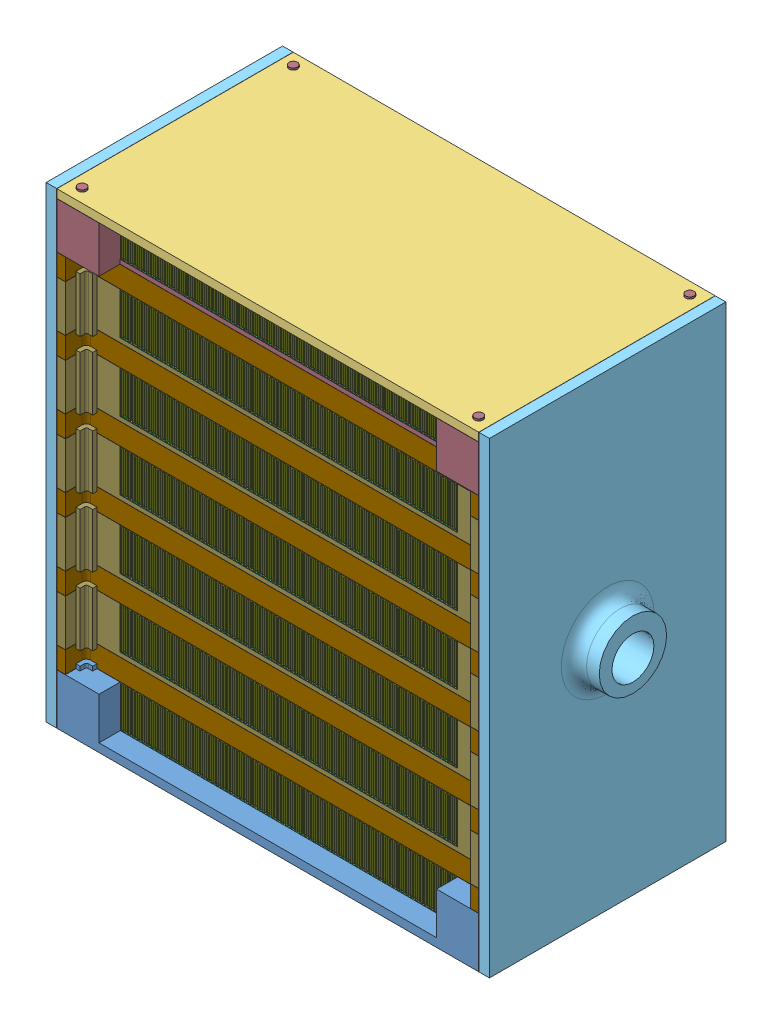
SolidWorks assembly 0. Heat Exchanger Assembly.SLDASM, configuration Default (file format 12000). Lengths in mm.
Overall size (117.2 111.35 56.1).
57 component instances, 13 part files, 171 mates.
Components (placement in the parent):
- 1. Base Plate-1: 1. Base Plate.SLDPRT [Default] at (-174.8595 0 0) x (-1 0 0) z (0 0 1) size (100.1 13 56.1)
- 10. Foil Top plate Side-1: 10. Foil Top plate Side.SLDPRT [Default] at (-174.8595 108.9 0) x (-1 0 0) z (0 0 1) size (100.1 0.05 56.1)
- 11. Top Plate-1: 11. Top Plate.SLDPRT [Default] at (-274.9595 108.9 0) size (100.1 2 56.1)
- 12. Foil Side-1: 12. Foil Side.SLDPRT [Default] at (-174.8095 109.5 -56.1) x (0 -1 0) z (0 0 -1) size (110.9 0.05 56.1)
- 13. Side Plate-1: 13. Side Plate.SLDPRT [Default] at (-174.8095 54.75 -28.05) x (0 -1 0) z (0 0 1) size (110.9 8.5 56.1)
- 2. Foil base plate side-1: 2. Foil base plate side.SLDPRT [Default] at (-264.9095 2 -5.05) size (80 0.05 41)
- 3. Fin Air Side-1: 3. Fin Air Side.SLDPRT [Default] at (-264.5095 2.075 -46.05) x (1 0 0) z (0 -1 0) size (79.95 41 9.9)
- 4. Foil Air Water Side-1: 4. Foil Air Water Side.SLDPRT [Default] at (-274.9595 12 0) size (100.1 0.05 56.1)
- 5. Water base plate-1: 5. Water base plate.SLDPRT [Default] at (-274.9595 12.05 0) size (100.1 5.05 56.1)
- 6. Foil Water Side-1: 6. Foil Water Side.SLDPRT [Default] at (-267.4595 13.05 -7) size (85.1 0.05 37.1)
- 7. Fin Water Side-1: 7. Fin Water Side.SLDPRT [Default] at (-267.4095 17.1 -43.7) x (0 0 1) z (0 1 0) size (37.05 85 4)
- 8. Air Base Plate-1: 8. Air Base Plate.SLDPRT [Default] at (-174.8595 17.15 0) x (-1 0 0) z (0 0 1) size (100.1 12.9 56.1)
- 4. Foil Air Water Side-2: 4. Foil Air Water Side.SLDPRT [Default] at (-274.9595 17.1 0) size (100.1 0.05 56.1)
- 2. Foil base plate side-2: 2. Foil base plate side.SLDPRT [Default] at (-264.9095 18.15 -5.05) size (80 0.05 41)
- 3. Fin Air Side-2: 3. Fin Air Side.SLDPRT [Default] at (-264.5095 18.225 -46.05) x (1 0 0) z (0 -1 0) size (79.95 41 9.9)
- 4. Foil Air Water Side-3: 4. Foil Air Water Side.SLDPRT [Default] at (-274.9595 33.25 0) size (100.1 0.05 56.1)
- 8. Air Base Plate-3: 8. Air Base Plate.SLDPRT [Default] at (-174.8595 33.3 0) x (-1 0 0) z (0 0 1) size (100.1 12.9 56.1)
- 7. Fin Water Side-2: 7. Fin Water Side.SLDPRT [Default] at (-267.4095 33.25 -43.7) x (0 0 1) z (0 1 0) size (37.05 85 4)
- 5. Water base plate-2: 5. Water base plate.SLDPRT [Default] at (-274.9595 28.2 0) size (100.1 5.05 56.1)
- 4. Foil Air Water Side-6: 4. Foil Air Water Side.SLDPRT [Default] at (-274.9595 28.15 0) size (100.1 0.05 56.1)
- 6. Foil Water Side-2: 6. Foil Water Side.SLDPRT [Default] at (-267.4595 29.2 -7) size (85.1 0.05 37.1)
- 3. Fin Air Side-4: 3. Fin Air Side.SLDPRT [Default] at (-264.5095 34.375 -46.05) x (1 0 0) z (0 -1 0) size (79.95 41 9.9)
- 2. Foil base plate side-5: 2. Foil base plate side.SLDPRT [Default] at (-264.9095 34.3 -5.05) size (80 0.05 41)
- 4. Foil Air Water Side-8: 4. Foil Air Water Side.SLDPRT [Default] at (-274.9595 44.3 0) size (100.1 0.05 56.1)
- 5. Water base plate-5: 5. Water base plate.SLDPRT [Default] at (-274.9595 44.35 0) size (100.1 5.05 56.1)
- 6. Foil Water Side-4: 6. Foil Water Side.SLDPRT [Default] at (-267.4595 45.35 -7) size (85.1 0.05 37.1)
- 7. Fin Water Side-4: 7. Fin Water Side.SLDPRT [Default] at (-267.4095 49.4 -43.7) x (0 0 1) z (0 1 0) size (37.05 85 4)
- 4. Foil Air Water Side-10: 4. Foil Air Water Side.SLDPRT [Default] at (-274.9595 49.4 0) size (100.1 0.05 56.1)
- 8. Air Base Plate-5: 8. Air Base Plate.SLDPRT [Default] at (-174.8595 49.45 0) x (-1 0 0) z (0 0 1) size (100.1 12.9 56.1)
- 2. Foil base plate side-7: 2. Foil base plate side.SLDPRT [Default] at (-264.9095 50.45 -5.05) size (80 0.05 41)
- 3. Fin Air Side-6: 3. Fin Air Side.SLDPRT [Default] at (-264.5095 50.525 -46.05) x (1 0 0) z (0 -1 0) size (79.95 41 9.9)
- 5. Water base plate-7: 5. Water base plate.SLDPRT [Default] at (-274.9595 60.5 0) size (100.1 5.05 56.1)
- 6. Foil Water Side-6: 6. Foil Water Side.SLDPRT [Default] at (-267.4595 61.5 -7) size (85.1 0.05 37.1)
- 4. Foil Air Water Side-12: 4. Foil Air Water Side.SLDPRT [Default] at (-274.9595 60.45 0) size (100.1 0.05 56.1)
- 7. Fin Water Side-6: 7. Fin Water Side.SLDPRT [Default] at (-267.4095 65.55 -43.7) x (0 0 1) z (0 1 0) size (37.05 85 4)
- 4. Foil Air Water Side-14: 4. Foil Air Water Side.SLDPRT [Default] at (-274.9595 65.55 0) size (100.1 0.05 56.1)
- 8. Air Base Plate-7: 8. Air Base Plate.SLDPRT [Default] at (-174.8595 65.6 0) x (-1 0 0) z (0 0 1) size (100.1 12.9 56.1)
- 3. Fin Air Side-8: 3. Fin Air Side.SLDPRT [Default] at (-264.5095 66.675 -46.05) x (1 0 0) z (0 -1 0) size (79.95 41 9.9)
- 2. Foil base plate side-9: 2. Foil base plate side.SLDPRT [Default] at (-264.9095 66.6 -5.05) size (80 0.05 41)
- 4. Foil Air Water Side-16: 4. Foil Air Water Side.SLDPRT [Default] at (-274.9595 76.6 0) size (100.1 0.05 56.1)
- 5. Water base plate-9: 5. Water base plate.SLDPRT [Default] at (-274.9595 76.65 0) size (100.1 5.05 56.1)
- 6. Foil Water Side-8: 6. Foil Water Side.SLDPRT [Default] at (-267.4595 77.65 -7) size (85.1 0.05 37.1)
- 7. Fin Water Side-8: 7. Fin Water Side.SLDPRT [Default] at (-267.4095 81.7 -43.7) x (0 0 1) z (0 1 0) size (37.05 85 4)
- 4. Foil Air Water Side-18: 4. Foil Air Water Side.SLDPRT [Default] at (-274.9595 81.7 0) size (100.1 0.05 56.1)
- 2. Foil base plate side-11: 2. Foil base plate side.SLDPRT [Default] at (-264.9095 82.75 -5.05) size (80 0.05 41)
- 3. Fin Air Side-10: 3. Fin Air Side.SLDPRT [Default] at (-264.5095 82.825 -46.05) x (1 0 0) z (0 -1 0) size (79.95 41 9.9)
- 8. Air Base Plate-9: 8. Air Base Plate.SLDPRT [Default] at (-174.8595 81.75 0) x (-1 0 0) z (0 0 1) size (100.1 12.9 56.1)
- 4. Foil Air Water Side-19: 4. Foil Air Water Side.SLDPRT [Default] at (-274.9595 92.75 0) size (100.1 0.05 56.1)
- 5. Water base plate-11: 5. Water base plate.SLDPRT [Default] at (-274.9595 92.8 0) size (100.1 5.05 56.1)
- 6. Foil Water Side-10: 6. Foil Water Side.SLDPRT [Default] at (-267.4595 93.8 -7) size (85.1 0.05 37.1)
- 7. Fin Water Side-10: 7. Fin Water Side.SLDPRT [Default] at (-267.4095 97.85 -43.7) x (0 0 1) z (0 1 0) size (37.05 85 4)
- 4. Foil Air Water Side-22: 4. Foil Air Water Side.SLDPRT [Default] at (-274.9595 97.85 0) size (100.1 0.05 56.1)
- 2. Foil base plate side-14: 2. Foil base plate side.SLDPRT [Default] at (-264.9595 98.9 -5.05) size (80 0.05 41)
- 3. Fin Air Side-13: 3. Fin Air Side.SLDPRT [Default] at (-264.5345 98.95 -46.05) x (1 0 0) z (0 -1 0) size (79.95 41 9.9)
- 9. Top Air Plate-2: 9. Top Air Plate.SLDPRT [Default] at (-184.8595 105.8 -46.1) x (-1 0 0) z (0 0 -1) size (100.1 14.45 56.1)
- 13. Side Plate-2: 13. Side Plate.SLDPRT [Default] at (-275.0095 54.75 -28.05) x (0 -1 0) z (0 0 -1) size (110.9 8.5 56.1)
- 12. Foil Side-2: 12. Foil Side.SLDPRT [Default] at (-274.9595 109.5 -56.1) x (0 -1 0) z (0 0 -1) size (110.9 0.05 56.1)
Mates (geometry in assembly coordinates):
- Coincident3: coincident anti-aligned: plane of 1. Base Plate-1 through (-174.8595 2 0) normal (0 1 0); plane of 2. Foil base plate side-1 through (-264.9095 2 -5.05) normal (0 -1 0)
- Width2: width anti-aligned: plane of 1. Base Plate-1 through (-264.9595 4.5 0) normal (1 0 0); plane of 2. Foil base plate side-1 through (-184.8595 4.5 0) normal (-1 0 0); plane of 1. Base Plate-1 through (-264.9095 2.05 -5.05) normal (-1 0 0); plane of 2. Foil base plate side-1 through (-184.9095 2.05 -5.05) normal (1 0 0)
- Parallel1: parallel anti-aligned: plane of 1. Base Plate-1 through (-268.4595 12 -43.1) normal (0 1 0); plane of 3. Fin Air Side-1 through (-264.5095 2.075 -46.05) normal (0 -1 0)
- Width4: width anti-aligned: plane of 3. Fin Air Side-1 through (-264.8845 2.075 -5.05) normal (-1 0 0); plane of 1. Base Plate-1 through (-184.9345 2.075 -5.05) normal (1 0 0); plane of 3. Fin Air Side-1 through (-264.9595 4.5 0) normal (1 0 0); plane of 1. Base Plate-1 through (-184.8595 4.5 0) normal (-1 0 0)
- Coincident6: coincident anti-aligned: plane of 1. Base Plate-1 through (-268.4595 12 -43.1) normal (0 1 0); plane of 4. Foil Air Water Side-1 through (-268.4595 12 -8) normal (0 -1 0)
- Coincident7: coincident aligned: plane of 1. Base Plate-1 through (-274.9595 4.5 0) normal (-1 0 0); plane of 4. Foil Air Water Side-1 through (-274.9595 12.05 0) normal (-1 0 0)
- Coincident8: coincident aligned: plane of 1. Base Plate-1 through (-174.8595 4.5 0) normal (0 0 1); plane of 4. Foil Air Water Side-1 through (-274.9595 12.05 0) normal (0 0 1)
- Coincident9: coincident anti-aligned: plane of 4. Foil Air Water Side-1 through (-268.4595 12.05 -8) normal (0 1 0); plane of 5. Water base plate-1 through (-274.9595 12.05 0) normal (0 -1 0)
- Coincident10: coincident aligned: plane of 1. Base Plate-1 through (-174.8595 4.5 -56.1) normal (0 0 -1); plane of 5. Water base plate-1 through (-274.9595 17.1 -56.1) normal (0 0 -1)
- Coincident11: coincident aligned: plane of 1. Base Plate-1 through (-174.8595 4.5 0) normal (1 0 0); plane of 5. Water base plate-1 through (-174.8595 17.1 0) normal (1 0 0)
- Coincident12: coincident anti-aligned: plane of 5. Water base plate-1 through (-274.9595 13.05 0) normal (0 1 0); plane of 6. Foil Water Side-1 through (-267.4595 13.05 -7) normal (0 -1 0)
- Width6: width anti-aligned: plane of 6. Foil Water Side-1 through (-182.3595 13.1 -7) normal (1 0 0); plane of 5. Water base plate-1 through (-267.4595 13.1 -7) normal (-1 0 0); plane of 6. Foil Water Side-1 through (-267.4595 13.05 0) normal (-1 0 0); plane of 5. Water base plate-1 through (-182.3595 13.05 0) normal (1 0 0)
- Width8: width anti-aligned: plane of 6. Foil Water Side-1 through (-267.4595 13.1 -7) normal (0 0 1); plane of 5. Water base plate-1 through (-267.4595 13.1 -44.1) normal (0 0 -1); plane of 6. Foil Water Side-1 through (-274.9595 17.1 -46.1) normal (0 0 -1); plane of 5. Water base plate-1 through (-274.9595 17.1 -5) normal (0 0 1)
- Width9: width anti-aligned: plane of 7. Fin Water Side-1 through (-182.4095 17.1 -43.7) normal (1 0 0); plane of 1. Base Plate-1 through (-267.4095 17.1 -43.7) normal (-1 0 0); plane of 7. Fin Water Side-1 through (-267.4595 12 0) normal (-1 0 0); plane of 1. Base Plate-1 through (-182.3595 12 0) normal (1 0 0)
- Width10: width anti-aligned: plane of 7. Fin Water Side-1 through (-182.4095 17.1 -44.075) normal (0 0 -1); plane of 5. Water base plate-1 through (-182.4095 17.1 -7.025) normal (0 0 1); plane of 7. Fin Water Side-1 through (-274.9595 17.1 -44.1) normal (0 0 1); plane of 5. Water base plate-1 through (-274.9595 17.1 -7) normal (0 0 -1)
- Coincident13: coincident aligned: plane of 2. Foil base plate side-1 through (-264.9095 2.05 -46.05) normal (0 0 -1); plane of 3. Fin Air Side-1 through (-264.5095 2.075 -46.05) normal (0 0 -1)
- Distance1: distance = 0.025 mm anti-aligned: plane of 3. Fin Air Side-1 through (-264.5095 2.075 -5.05) normal (0 -1 0); plane of 2. Foil base plate side-1 through (-264.9095 2.05 -5.05) normal (0 1 0)
- Coincident14: coincident anti-aligned: plane of 5. Water base plate-1 through (-274.9595 17.1 0) normal (0 1 0); plane of 4. Foil Air Water Side-2 through (-268.4595 17.1 -8) normal (0 -1 0)
- Coincident15: coincident aligned: plane of 1. Base Plate-1 through (-274.9595 4.5 0) normal (-1 0 0); plane of 4. Foil Air Water Side-2 through (-274.9595 17.15 0) normal (-1 0 0)
- Coincident16: coincident aligned: plane of 1. Base Plate-1 through (-174.8595 4.5 0) normal (0 0 1); plane of 4. Foil Air Water Side-2 through (-274.9595 17.15 0) normal (0 0 1)
- Coincident21: coincident anti-aligned: plane of 8. Air Base Plate-1 through (-174.8595 17.15 0) normal (0 -1 0); plane of 4. Foil Air Water Side-2 through (-268.4595 17.15 -8) normal (0 1 0)
- Coincident22: coincident aligned: plane of 5. Water base plate-1 through (-274.9595 17.1 -56.1) normal (0 0 -1); plane of 8. Air Base Plate-1 through (-174.8595 28.15 -56.1) normal (0 0 -1)
- Coincident23: coincident aligned: plane of 5. Water base plate-1 through (-174.8595 17.1 0) normal (1 0 0); plane of 8. Air Base Plate-1 through (-174.8595 28.15 0) normal (1 0 0)
- Tangent1: tangent anti-aligned: cylinder of 6. Foil Water Side-1; cylinder of 7. Fin Water Side-1 through (-182.4095 13.475 -33.8) axis (-1 0 0) radius 0.375
- Distance4: distance = 5.05 mm aligned: plane of 2. Foil base plate side-1 through (-264.9095 2.05 -5.05) normal (0 0 1); plane of 1. Base Plate-1 through (-174.8595 4.5 0) normal (0 0 1)
- Width11: width anti-aligned: plane of 7. Fin Water Side-2 through (-182.4095 33.25 -44.075) normal (0 0 -1); plane of 7. Fin Water Side-2 through (-182.4095 33.25 -7.025) normal (0 0 1); plane of 5. Water base plate-2 through (-274.9595 33.25 -44.1) normal (0 0 1); plane of 5. Water base plate-2 through (-274.9595 33.25 -7) normal (0 0 -1)
- Coincident24: coincident aligned: plane of 2. Foil base plate side-2 through (-264.9095 18.2 -46.05) normal (0 0 -1); plane of 3. Fin Air Side-2 through (-264.5095 18.225 -46.05) normal (0 0 -1)
- Distance5: distance = 0.025 mm anti-aligned: plane of 3. Fin Air Side-2 through (-264.5095 18.225 -5.05) normal (0 -1 0); plane of 2. Foil base plate side-2 through (-264.9095 18.2 -5.05) normal (0 1 0)
- Coincident25: coincident anti-aligned: plane of 4. Foil Air Water Side-3 through (-268.4595 33.25 -8) normal (0 -1 0); plane of 5. Water base plate-2 through (-274.9595 33.25 0) normal (0 1 0)
- Coincident26: coincident anti-aligned: plane of 4. Foil Air Water Side-3 through (-268.4595 33.3 -8) normal (0 1 0); plane of 8. Air Base Plate-3 through (-174.8595 33.3 0) normal (0 -1 0)
- Coincident27: coincident aligned: plane of 8. Air Base Plate-3 through (-174.8595 44.3 -56.1) normal (0 0 -1); plane of 5. Water base plate-2 through (-274.9595 33.25 -56.1) normal (0 0 -1)
- Coincident28: coincident aligned: plane of 8. Air Base Plate-3 through (-174.8595 44.3 0) normal (1 0 0); plane of 5. Water base plate-2 through (-174.8595 33.25 0) normal (1 0 0)
- Coincident29: coincident anti-aligned: plane of 8. Air Base Plate-1 through (-174.8595 18.15 0) normal (0 1 0); plane of 2. Foil base plate side-2 through (-264.9095 18.15 -5.05) normal (0 -1 0)
- Width12: width anti-aligned: plane of 1. Base Plate-1 through (-264.9595 4.5 0) normal (1 0 0); plane of 1. Base Plate-1 through (-184.8595 4.5 0) normal (-1 0 0); plane of 2. Foil base plate side-2 through (-264.9095 18.2 -5.05) normal (-1 0 0); plane of 2. Foil base plate side-2 through (-184.9095 18.2 -5.05) normal (1 0 0)
- Parallel4: parallel anti-aligned: plane of 8. Air Base Plate-1 through (-174.8595 28.15 0) normal (0 1 0); plane of 3. Fin Air Side-2 through (-264.5095 18.225 -46.05) normal (0 -1 0)
- Width13: width anti-aligned: plane of 3. Fin Air Side-2 through (-264.8845 18.225 -5.05) normal (-1 0 0); plane of 3. Fin Air Side-2 through (-184.9345 18.225 -5.05) normal (1 0 0); plane of 1. Base Plate-1 through (-264.9595 4.5 0) normal (1 0 0); plane of 1. Base Plate-1 through (-184.8595 4.5 0) normal (-1 0 0)
- Coincident31: coincident aligned: plane of 1. Base Plate-1 through (-174.8595 4.5 -56.1) normal (0 0 -1); plane of 5. Water base plate-2 through (-274.9595 33.25 -56.1) normal (0 0 -1)
- Coincident32: coincident aligned: plane of 1. Base Plate-1 through (-174.8595 4.5 0) normal (1 0 0); plane of 5. Water base plate-2 through (-174.8595 33.25 0) normal (1 0 0)
- Width14: width anti-aligned: plane of 6. Foil Water Side-1 through (-182.3595 13.1 -7) normal (1 0 0); plane of 6. Foil Water Side-1 through (-267.4595 13.1 -7) normal (-1 0 0); plane of 5. Water base plate-2 through (-267.4595 29.2 0) normal (-1 0 0); plane of 5. Water base plate-2 through (-182.3595 29.2 0) normal (1 0 0)
- Width15: width anti-aligned: plane of 6. Foil Water Side-1 through (-267.4595 13.1 -7) normal (0 0 1); plane of 6. Foil Water Side-1 through (-267.4595 13.1 -44.1) normal (0 0 -1); plane of 5. Water base plate-2 through (-274.9595 33.25 -46.1) normal (0 0 -1); plane of 5. Water base plate-2 through (-274.9595 33.25 -5) normal (0 0 1)
- Width16: width anti-aligned: plane of 7. Fin Water Side-2 through (-182.4095 33.25 -43.7) normal (1 0 0); plane of 7. Fin Water Side-2 through (-267.4095 33.25 -43.7) normal (-1 0 0); plane of 1. Base Plate-1 through (-267.4595 12 0) normal (-1 0 0); plane of 1. Base Plate-1 through (-182.3595 12 0) normal (1 0 0)
- Coincident41: coincident aligned: plane of 4. Foil Air Water Side-3 through (-174.8595 33.3 -44.1) normal (1 0 0); plane of 8. Air Base Plate-3 through (-174.8595 44.3 0) normal (1 0 0)
- Coincident42: coincident aligned: plane of 4. Foil Air Water Side-3 through (-174.8595 33.3 -56.1) normal (0 0 -1); plane of 8. Air Base Plate-3 through (-174.8595 44.3 -56.1) normal (0 0 -1)
- Distance7: distance = 5.05 mm aligned: plane of 2. Foil base plate side-2 through (-264.9095 18.2 -5.05) normal (0 0 1); plane of 1. Base Plate-1 through (-174.8595 4.5 0) normal (0 0 1)
- Coincident45: coincident anti-aligned: plane of 8. Air Base Plate-1 through (-174.8595 28.15 0) normal (0 1 0); plane of 4. Foil Air Water Side-6 through (-268.4595 28.15 -8) normal (0 -1 0)
- Coincident46: coincident aligned: plane of 8. Air Base Plate-1 through (-174.8595 28.15 0) normal (1 0 0); plane of 4. Foil Air Water Side-6 through (-174.8595 28.2 -44.1) normal (1 0 0)
- Coincident47: coincident aligned: plane of 8. Air Base Plate-1 through (-174.8595 28.15 -56.1) normal (0 0 -1); plane of 4. Foil Air Water Side-6 through (-174.8595 28.2 -56.1) normal (0 0 -1)
- Coincident48: coincident anti-aligned: plane of 5. Water base plate-2 through (-274.9595 28.2 0) normal (0 -1 0); plane of 4. Foil Air Water Side-6 through (-268.4595 28.2 -8) normal (0 1 0)
- Coincident49: coincident anti-aligned: plane of 5. Water base plate-2 through (-274.9595 29.2 0) normal (0 1 0); plane of 6. Foil Water Side-2 through (-267.4595 29.2 -7) normal (0 -1 0)
- Width23: width anti-aligned: plane of 6. Foil Water Side-2 through (-182.3595 29.25 -7) normal (1 0 0); plane of 6. Foil Water Side-2 through (-267.4595 29.25 -7) normal (-1 0 0); plane of 5. Water base plate-1 through (-267.4595 13.05 0) normal (-1 0 0); plane of 5. Water base plate-1 through (-182.3595 13.05 0) normal (1 0 0)
- Width24: width anti-aligned: plane of 6. Foil Water Side-2 through (-267.4595 29.25 -7) normal (0 0 1); plane of 6. Foil Water Side-2 through (-267.4595 29.25 -44.1) normal (0 0 -1); plane of 5. Water base plate-1 through (-274.9595 17.1 -46.1) normal (0 0 -1); plane of 5. Water base plate-1 through (-274.9595 17.1 -5) normal (0 0 1)
- Tangent2: tangent anti-aligned: cylinder of 7. Fin Water Side-2 through (-182.4095 29.625 -36) axis (-1 0 0) radius 0.375; plane of 6. Foil Water Side-2 through (-267.4595 29.25 -7) normal (0 1 0)
- Coincident51: coincident aligned: plane of 3. Fin Air Side-4 through (-264.5095 34.375 -46.05) normal (0 0 -1); plane of 2. Foil base plate side-5 through (-264.9095 34.35 -46.05) normal (0 0 -1)
- Distance8: distance = 0.025 mm anti-aligned: plane of 3. Fin Air Side-4 through (-264.5095 34.375 -5.05) normal (0 -1 0); plane of 2. Foil base plate side-5 through (-264.9095 34.35 -5.05) normal (0 1 0)
- Coincident52: coincident anti-aligned: plane of 8. Air Base Plate-3 through (-174.8595 34.3 0) normal (0 1 0); plane of 2. Foil base plate side-5 through (-264.9095 34.3 -5.05) normal (0 -1 0)
- Width27: width anti-aligned: plane of 1. Base Plate-1 through (-264.9595 4.5 0) normal (1 0 0); plane of 1. Base Plate-1 through (-184.8595 4.5 0) normal (-1 0 0); plane of 2. Foil base plate side-5 through (-264.9095 34.35 -5.05) normal (-1 0 0); plane of 2. Foil base plate side-5 through (-184.9095 34.35 -5.05) normal (1 0 0)
- Parallel5: parallel anti-aligned: plane of 8. Air Base Plate-1 through (-174.8595 28.15 0) normal (0 1 0); plane of 3. Fin Air Side-4 through (-264.5095 34.375 -46.05) normal (0 -1 0)
- Width28: width anti-aligned: plane of 3. Fin Air Side-4 through (-264.8845 34.375 -5.05) normal (-1 0 0); plane of 3. Fin Air Side-4 through (-184.9345 34.375 -5.05) normal (1 0 0); plane of 1. Base Plate-1 through (-264.9595 4.5 0) normal (1 0 0); plane of 1. Base Plate-1 through (-184.8595 4.5 0) normal (-1 0 0)
- Distance9: distance = 5.05 mm aligned: plane of 2. Foil base plate side-5 through (-264.9095 34.35 -5.05) normal (0 0 1); plane of 1. Base Plate-1 through (-174.8595 4.5 0) normal (0 0 1)
- Coincident54: coincident anti-aligned: plane of 8. Air Base Plate-3 through (-174.8595 44.3 0) normal (0 1 0); plane of 4. Foil Air Water Side-8 through (-268.4595 44.3 -8) normal (0 -1 0)
- Coincident55: coincident aligned: plane of 8. Air Base Plate-1 through (-174.8595 28.15 0) normal (1 0 0); plane of 4. Foil Air Water Side-8 through (-174.8595 44.35 -44.1) normal (1 0 0)
- Coincident56: coincident aligned: plane of 8. Air Base Plate-1 through (-174.8595 28.15 -56.1) normal (0 0 -1); plane of 4. Foil Air Water Side-8 through (-174.8595 44.35 -56.1) normal (0 0 -1)
- Coincident70: coincident anti-aligned: plane of 4. Foil Air Water Side-8 through (-268.4595 44.35 -8) normal (0 1 0); plane of 5. Water base plate-5 through (-274.9595 44.35 0) normal (0 -1 0)
- Coincident71: coincident aligned: plane of 1. Base Plate-1 through (-174.8595 4.5 0) normal (1 0 0); plane of 5. Water base plate-5 through (-174.8595 49.4 0) normal (1 0 0)
- Coincident72: coincident aligned: plane of 1. Base Plate-1 through (-174.8595 4.5 -56.1) normal (0 0 -1); plane of 5. Water base plate-5 through (-274.9595 49.4 -56.1) normal (0 0 -1)
- Tangent3: tangent anti-aligned: plane of 6. Foil Water Side-4 through (-267.4595 45.4 -7) normal (0 1 0); cylinder of 7. Fin Water Side-4 through (-182.4095 45.775 -36) axis (-1 0 0) radius 0.375
- Width31: width anti-aligned: plane of 7. Fin Water Side-4 through (-182.4095 49.4 -44.075) normal (0 0 -1); plane of 7. Fin Water Side-4 through (-182.4095 49.4 -7.025) normal (0 0 1); plane of 5. Water base plate-2 through (-274.9595 33.25 -44.1) normal (0 0 1); plane of 5. Water base plate-2 through (-274.9595 33.25 -7) normal (0 0 -1)
- Width32: width anti-aligned: plane of 7. Fin Water Side-4 through (-182.4095 49.4 -43.7) normal (1 0 0); plane of 7. Fin Water Side-4 through (-267.4095 49.4 -43.7) normal (-1 0 0); plane of 1. Base Plate-1 through (-267.4595 12 0) normal (-1 0 0); plane of 1. Base Plate-1 through (-182.3595 12 0) normal (1 0 0)
- Coincident75: coincident anti-aligned: plane of 5. Water base plate-5 through (-274.9595 45.35 0) normal (0 1 0); plane of 6. Foil Water Side-4 through (-267.4595 45.35 -7) normal (0 -1 0)
- Width33: width anti-aligned: plane of 6. Foil Water Side-4 through (-182.3595 45.4 -7) normal (1 0 0); plane of 6. Foil Water Side-4 through (-267.4595 45.4 -7) normal (-1 0 0); plane of 5. Water base plate-1 through (-267.4595 13.05 0) normal (-1 0 0); plane of 5. Water base plate-1 through (-182.3595 13.05 0) normal (1 0 0)
- Width34: width anti-aligned: plane of 6. Foil Water Side-4 through (-267.4595 45.4 -7) normal (0 0 1); plane of 6. Foil Water Side-4 through (-267.4595 45.4 -44.1) normal (0 0 -1); plane of 5. Water base plate-1 through (-274.9595 17.1 -46.1) normal (0 0 -1); plane of 5. Water base plate-1 through (-274.9595 17.1 -5) normal (0 0 1)
- Coincident76: coincident anti-aligned: plane of 5. Water base plate-5 through (-274.9595 49.4 0) normal (0 1 0); plane of 4. Foil Air Water Side-10 through (-268.4595 49.4 -8) normal (0 -1 0)
- Coincident77: coincident aligned: plane of 8. Air Base Plate-3 through (-174.8595 44.3 0) normal (1 0 0); plane of 4. Foil Air Water Side-10 through (-174.8595 49.45 -44.1) normal (1 0 0)
- Coincident78: coincident aligned: plane of 8. Air Base Plate-3 through (-174.8595 44.3 -56.1) normal (0 0 -1); plane of 4. Foil Air Water Side-10 through (-174.8595 49.45 -56.1) normal (0 0 -1)
- Coincident81: coincident anti-aligned: plane of 4. Foil Air Water Side-10 through (-268.4595 49.45 -8) normal (0 1 0); plane of 8. Air Base Plate-5 through (-174.8595 49.45 0) normal (0 -1 0)
- Coincident82: coincident aligned: plane of 5. Water base plate-2 through (-274.9595 33.25 -56.1) normal (0 0 -1); plane of 8. Air Base Plate-5 through (-174.8595 60.45 -56.1) normal (0 0 -1)
- Coincident83: coincident aligned: plane of 5. Water base plate-2 through (-174.8595 33.25 0) normal (1 0 0); plane of 8. Air Base Plate-5 through (-174.8595 60.45 0) normal (1 0 0)
- Coincident86: coincident aligned: plane of 2. Foil base plate side-7 through (-264.9095 50.5 -46.05) normal (0 0 -1); plane of 3. Fin Air Side-6 through (-264.5095 50.525 -46.05) normal (0 0 -1)
- Distance12: distance = 0.025 mm anti-aligned: plane of 3. Fin Air Side-6 through (-264.5095 50.525 -5.05) normal (0 -1 0); plane of 2. Foil base plate side-7 through (-264.9095 50.5 -5.05) normal (0 1 0)
- Coincident87: coincident anti-aligned: plane of 8. Air Base Plate-5 through (-174.8595 50.45 0) normal (0 1 0); plane of 2. Foil base plate side-7 through (-264.9095 50.45 -5.05) normal (0 -1 0)
- Width39: width anti-aligned: plane of 1. Base Plate-1 through (-264.9595 4.5 0) normal (1 0 0); plane of 1. Base Plate-1 through (-184.8595 4.5 0) normal (-1 0 0); plane of 2. Foil base plate side-7 through (-264.9095 50.5 -5.05) normal (-1 0 0); plane of 2. Foil base plate side-7 through (-184.9095 50.5 -5.05) normal (1 0 0)
- Parallel7: parallel anti-aligned: plane of 8. Air Base Plate-1 through (-174.8595 28.15 0) normal (0 1 0); plane of 3. Fin Air Side-6 through (-264.5095 50.525 -46.05) normal (0 -1 0)
- Width40: width anti-aligned: plane of 3. Fin Air Side-6 through (-264.8845 50.525 -5.05) normal (-1 0 0); plane of 3. Fin Air Side-6 through (-184.9345 50.525 -5.05) normal (1 0 0); plane of 1. Base Plate-1 through (-264.9595 4.5 0) normal (1 0 0); plane of 1. Base Plate-1 through (-184.8595 4.5 0) normal (-1 0 0)
- Distance13: distance = 5.05 mm aligned: plane of 2. Foil base plate side-7 through (-264.9095 50.5 -5.05) normal (0 0 1); plane of 1. Base Plate-1 through (-174.8595 4.5 0) normal (0 0 1)
- Coincident89: coincident anti-aligned: plane of 5. Water base plate-7 through (-274.9595 60.5 0) normal (0 -1 0); plane of 4. Foil Air Water Side-12 through (-268.4595 60.5 -8) normal (0 1 0)
- Coincident90: coincident anti-aligned: plane of 5. Water base plate-7 through (-274.9595 61.5 0) normal (0 1 0); plane of 6. Foil Water Side-6 through (-267.4595 61.5 -7) normal (0 -1 0)
- Coincident91: coincident anti-aligned: plane of 8. Air Base Plate-5 through (-174.8595 60.45 0) normal (0 1 0); plane of 4. Foil Air Water Side-12 through (-268.4595 60.45 -8) normal (0 -1 0)
- Coincident93: coincident aligned: plane of 1. Base Plate-1 through (-174.8595 4.5 0) normal (1 0 0); plane of 5. Water base plate-7 through (-174.8595 65.55 0) normal (1 0 0)
- Coincident94: coincident aligned: plane of 1. Base Plate-1 through (-174.8595 4.5 -56.1) normal (0 0 -1); plane of 5. Water base plate-7 through (-274.9595 65.55 -56.1) normal (0 0 -1)
- Width43: width anti-aligned: plane of 6. Foil Water Side-6 through (-182.3595 61.55 -7) normal (1 0 0); plane of 6. Foil Water Side-6 through (-267.4595 61.55 -7) normal (-1 0 0); plane of 5. Water base plate-1 through (-267.4595 13.05 0) normal (-1 0 0); plane of 5. Water base plate-1 through (-182.3595 13.05 0) normal (1 0 0)
- Width44: width anti-aligned: plane of 6. Foil Water Side-6 through (-267.4595 61.55 -7) normal (0 0 1); plane of 6. Foil Water Side-6 through (-267.4595 61.55 -44.1) normal (0 0 -1); plane of 5. Water base plate-1 through (-274.9595 17.1 -46.1) normal (0 0 -1); plane of 5. Water base plate-1 through (-274.9595 17.1 -5) normal (0 0 1)
- Coincident97: coincident aligned: plane of 8. Air Base Plate-1 through (-174.8595 28.15 0) normal (1 0 0); plane of 4. Foil Air Water Side-12 through (-174.8595 60.5 -44.1) normal (1 0 0)
- Coincident98: coincident aligned: plane of 8. Air Base Plate-1 through (-174.8595 28.15 -56.1) normal (0 0 -1); plane of 4. Foil Air Water Side-12 through (-174.8595 60.5 -56.1) normal (0 0 -1)
- Tangent5: tangent anti-aligned: plane of 6. Foil Water Side-6 through (-267.4595 61.55 -7) normal (0 1 0); cylinder of 7. Fin Water Side-6 through (-182.4095 61.925 -36) axis (-1 0 0) radius 0.375
- Width47: width anti-aligned: plane of 7. Fin Water Side-6 through (-182.4095 65.55 -44.075) normal (0 0 -1); plane of 7. Fin Water Side-6 through (-182.4095 65.55 -7.025) normal (0 0 1); plane of 5. Water base plate-2 through (-274.9595 33.25 -44.1) normal (0 0 1); plane of 5. Water base plate-2 through (-274.9595 33.25 -7) normal (0 0 -1)
- Width48: width anti-aligned: plane of 7. Fin Water Side-6 through (-182.4095 65.55 -43.7) normal (1 0 0); plane of 7. Fin Water Side-6 through (-267.4095 65.55 -43.7) normal (-1 0 0); plane of 1. Base Plate-1 through (-267.4595 12 0) normal (-1 0 0); plane of 1. Base Plate-1 through (-182.3595 12 0) normal (1 0 0)
- Coincident105: coincident anti-aligned: plane of 4. Foil Air Water Side-14 through (-268.4595 65.6 -8) normal (0 1 0); plane of 8. Air Base Plate-7 through (-174.8595 65.6 0) normal (0 -1 0)
- Coincident106: coincident aligned: plane of 3. Fin Air Side-8 through (-264.5095 66.675 -46.05) normal (0 0 -1); plane of 2. Foil base plate side-9 through (-264.9095 66.65 -46.05) normal (0 0 -1)
- Distance16: distance = 0.025 mm anti-aligned: plane of 3. Fin Air Side-8 through (-264.5095 66.675 -5.05) normal (0 -1 0); plane of 2. Foil base plate side-9 through (-264.9095 66.65 -5.05) normal (0 1 0)
- Coincident107: coincident anti-aligned: plane of 8. Air Base Plate-7 through (-174.8595 66.6 0) normal (0 1 0); plane of 2. Foil base plate side-9 through (-264.9095 66.6 -5.05) normal (0 -1 0)
- Coincident108: coincident anti-aligned: plane of 5. Water base plate-7 through (-274.9595 65.55 0) normal (0 1 0); plane of 4. Foil Air Water Side-14 through (-268.4595 65.55 -8) normal (0 -1 0)
- Coincident109: coincident aligned: plane of 8. Air Base Plate-3 through (-174.8595 44.3 0) normal (1 0 0); plane of 4. Foil Air Water Side-14 through (-174.8595 65.6 -44.1) normal (1 0 0)
- Coincident110: coincident aligned: plane of 8. Air Base Plate-3 through (-174.8595 44.3 -56.1) normal (0 0 -1); plane of 4. Foil Air Water Side-14 through (-174.8595 65.6 -56.1) normal (0 0 -1)
- Coincident111: coincident aligned: plane of 5. Water base plate-2 through (-274.9595 33.25 -56.1) normal (0 0 -1); plane of 8. Air Base Plate-7 through (-174.8595 76.6 -56.1) normal (0 0 -1)
- Coincident112: coincident aligned: plane of 5. Water base plate-2 through (-174.8595 33.25 0) normal (1 0 0); plane of 8. Air Base Plate-7 through (-174.8595 76.6 0) normal (1 0 0)
- Width51: width anti-aligned: plane of 1. Base Plate-1 through (-264.9595 4.5 0) normal (1 0 0); plane of 1. Base Plate-1 through (-184.8595 4.5 0) normal (-1 0 0); plane of 2. Foil base plate side-9 through (-264.9095 66.65 -5.05) normal (-1 0 0); plane of 2. Foil base plate side-9 through (-184.9095 66.65 -5.05) normal (1 0 0)
- Parallel9: parallel anti-aligned: plane of 8. Air Base Plate-1 through (-174.8595 28.15 0) normal (0 1 0); plane of 3. Fin Air Side-8 through (-264.5095 66.675 -46.05) normal (0 -1 0)
- Width52: width anti-aligned: plane of 3. Fin Air Side-8 through (-264.8845 66.675 -5.05) normal (-1 0 0); plane of 3. Fin Air Side-8 through (-184.9345 66.675 -5.05) normal (1 0 0); plane of 1. Base Plate-1 through (-264.9595 4.5 0) normal (1 0 0); plane of 1. Base Plate-1 through (-184.8595 4.5 0) normal (-1 0 0)
- Distance17: distance = 5.05 mm aligned: plane of 2. Foil base plate side-9 through (-264.9095 66.65 -5.05) normal (0 0 1); plane of 1. Base Plate-1 through (-174.8595 4.5 0) normal (0 0 1)
- Coincident120: coincident anti-aligned: plane of 4. Foil Air Water Side-16 through (-268.4595 76.65 -8) normal (0 1 0); plane of 5. Water base plate-9 through (-274.9595 76.65 0) normal (0 -1 0)
- Coincident121: coincident anti-aligned: plane of 5. Water base plate-9 through (-274.9595 77.65 0) normal (0 1 0); plane of 6. Foil Water Side-8 through (-267.4595 77.65 -7) normal (0 -1 0)
- Coincident122: coincident anti-aligned: plane of 8. Air Base Plate-7 through (-174.8595 76.6 0) normal (0 1 0); plane of 4. Foil Air Water Side-16 through (-268.4595 76.6 -8) normal (0 -1 0)
- Coincident123: coincident aligned: plane of 1. Base Plate-1 through (-174.8595 4.5 0) normal (1 0 0); plane of 5. Water base plate-9 through (-174.8595 81.7 0) normal (1 0 0)
- Coincident124: coincident aligned: plane of 1. Base Plate-1 through (-174.8595 4.5 -56.1) normal (0 0 -1); plane of 5. Water base plate-9 through (-274.9595 81.7 -56.1) normal (0 0 -1)
- Width55: width anti-aligned: plane of 6. Foil Water Side-8 through (-182.3595 77.7 -7) normal (1 0 0); plane of 6. Foil Water Side-8 through (-267.4595 77.7 -7) normal (-1 0 0); plane of 5. Water base plate-1 through (-267.4595 13.05 0) normal (-1 0 0); plane of 5. Water base plate-1 through (-182.3595 13.05 0) normal (1 0 0)
- Width56: width anti-aligned: plane of 6. Foil Water Side-8 through (-267.4595 77.7 -7) normal (0 0 1); plane of 6. Foil Water Side-8 through (-267.4595 77.7 -44.1) normal (0 0 -1); plane of 5. Water base plate-1 through (-274.9595 17.1 -46.1) normal (0 0 -1); plane of 5. Water base plate-1 through (-274.9595 17.1 -5) normal (0 0 1)
- Coincident125: coincident aligned: plane of 8. Air Base Plate-1 through (-174.8595 28.15 0) normal (1 0 0); plane of 4. Foil Air Water Side-16 through (-174.8595 76.65 -44.1) normal (1 0 0)
- Coincident126: coincident aligned: plane of 8. Air Base Plate-1 through (-174.8595 28.15 -56.1) normal (0 0 -1); plane of 4. Foil Air Water Side-16 through (-174.8595 76.65 -56.1) normal (0 0 -1)
- Tangent6: tangent anti-aligned: plane of 6. Foil Water Side-8 through (-267.4595 77.7 -7) normal (0 1 0); cylinder of 7. Fin Water Side-8 through (-182.4095 78.075 -36) axis (-1 0 0) radius 0.375
- Width59: width anti-aligned: plane of 7. Fin Water Side-8 through (-182.4095 81.7 -44.075) normal (0 0 -1); plane of 7. Fin Water Side-8 through (-182.4095 81.7 -7.025) normal (0 0 1); plane of 5. Water base plate-2 through (-274.9595 33.25 -44.1) normal (0 0 1); plane of 5. Water base plate-2 through (-274.9595 33.25 -7) normal (0 0 -1)
- Width60: width anti-aligned: plane of 7. Fin Water Side-8 through (-182.4095 81.7 -43.7) normal (1 0 0); plane of 7. Fin Water Side-8 through (-267.4095 81.7 -43.7) normal (-1 0 0); plane of 1. Base Plate-1 through (-267.4595 12 0) normal (-1 0 0); plane of 1. Base Plate-1 through (-182.3595 12 0) normal (1 0 0)
- Coincident133: coincident aligned: plane of 1. Base Plate-1 through (-174.8595 0 0) normal (0 -1 0); plane of 13. Side Plate-1 through (-172.3095 0 -28.05) normal (0 -1 0)
- Coincident134: coincident aligned: plane of 1. Base Plate-1 through (-174.8595 4.5 -56.1) normal (0 0 -1); plane of 13. Side Plate-1 through (-172.3095 54.75 -56.1) normal (0 0 -1)
- Coincident136: coincident anti-aligned: plane of 4. Foil Air Water Side-18 through (-268.4595 81.75 -8) normal (0 1 0); plane of 8. Air Base Plate-9 through (-174.8595 81.75 0) normal (0 -1 0)
- Coincident137: coincident aligned: plane of 2. Foil base plate side-11 through (-264.9095 82.8 -46.05) normal (0 0 -1); plane of 3. Fin Air Side-10 through (-264.5095 82.825 -46.05) normal (0 0 -1)
- Distance20: distance = 0.025 mm anti-aligned: plane of 3. Fin Air Side-10 through (-264.5095 82.825 -5.05) normal (0 -1 0); plane of 2. Foil base plate side-11 through (-264.9095 82.8 -5.05) normal (0 1 0)
- Coincident138: coincident anti-aligned: plane of 2. Foil base plate side-11 through (-264.9095 82.75 -5.05) normal (0 -1 0); plane of 8. Air Base Plate-9 through (-174.8595 82.75 0) normal (0 1 0)
- Coincident139: coincident anti-aligned: plane of 5. Water base plate-9 through (-274.9595 81.7 0) normal (0 1 0); plane of 4. Foil Air Water Side-18 through (-268.4595 81.7 -8) normal (0 -1 0)
- Coincident140: coincident aligned: plane of 8. Air Base Plate-3 through (-174.8595 44.3 0) normal (1 0 0); plane of 4. Foil Air Water Side-18 through (-174.8595 81.75 -44.1) normal (1 0 0)
- Coincident141: coincident aligned: plane of 8. Air Base Plate-3 through (-174.8595 44.3 -56.1) normal (0 0 -1); plane of 4. Foil Air Water Side-18 through (-174.8595 81.75 -56.1) normal (0 0 -1)
- Coincident142: coincident aligned: plane of 5. Water base plate-2 through (-274.9595 33.25 -56.1) normal (0 0 -1); plane of 8. Air Base Plate-9 through (-174.8595 92.75 -56.1) normal (0 0 -1)
- Coincident143: coincident aligned: plane of 5. Water base plate-2 through (-174.8595 33.25 0) normal (1 0 0); plane of 8. Air Base Plate-9 through (-174.8595 92.75 0) normal (1 0 0)
- Width63: width anti-aligned: plane of 1. Base Plate-1 through (-264.9595 4.5 0) normal (1 0 0); plane of 1. Base Plate-1 through (-184.8595 4.5 0) normal (-1 0 0); plane of 2. Foil base plate side-11 through (-264.9095 82.8 -5.05) normal (-1 0 0); plane of 2. Foil base plate side-11 through (-184.9095 82.8 -5.05) normal (1 0 0)
- Parallel11: parallel anti-aligned: plane of 8. Air Base Plate-1 through (-174.8595 28.15 0) normal (0 1 0); plane of 3. Fin Air Side-10 through (-264.5095 82.825 -46.05) normal (0 -1 0)
- Width64: width anti-aligned: plane of 3. Fin Air Side-10 through (-264.8845 82.825 -5.05) normal (-1 0 0); plane of 3. Fin Air Side-10 through (-184.9345 82.825 -5.05) normal (1 0 0); plane of 1. Base Plate-1 through (-264.9595 4.5 0) normal (1 0 0); plane of 1. Base Plate-1 through (-184.8595 4.5 0) normal (-1 0 0)
- Distance21: distance = 5.05 mm aligned: plane of 2. Foil base plate side-11 through (-264.9095 82.8 -5.05) normal (0 0 1); plane of 1. Base Plate-1 through (-174.8595 4.5 0) normal (0 0 1)
- Coincident147: coincident aligned: plane of 8. Air Base Plate-3 through (-174.8595 44.3 0) normal (1 0 0); plane of 4. Foil Air Water Side-19 through (-174.8595 92.8 -44.1) normal (1 0 0)
- Coincident148: coincident aligned: plane of 8. Air Base Plate-3 through (-174.8595 44.3 -56.1) normal (0 0 -1); plane of 4. Foil Air Water Side-19 through (-174.8595 92.8 -56.1) normal (0 0 -1)
- Coincident159: coincident anti-aligned: plane of 8. Air Base Plate-9 through (-174.8595 92.75 0) normal (0 1 0); plane of 4. Foil Air Water Side-19 through (-268.4595 92.75 -8) normal (0 -1 0)
- Coincident160: coincident anti-aligned: plane of 5. Water base plate-11 through (-274.9595 93.8 0) normal (0 1 0); plane of 6. Foil Water Side-10 through (-267.4595 93.8 -7) normal (0 -1 0)
- Tangent7: tangent anti-aligned: plane of 6. Foil Water Side-10 through (-267.4595 93.85 -7) normal (0 1 0); cylinder of 7. Fin Water Side-10 through (-182.4095 94.225 -36) axis (-1 0 0) radius 0.375
- Coincident161: coincident anti-aligned: plane of 4. Foil Air Water Side-19 through (-268.4595 92.8 -8) normal (0 1 0); plane of 5. Water base plate-11 through (-274.9595 92.8 0) normal (0 -1 0)
- Coincident162: coincident aligned: plane of 1. Base Plate-1 through (-174.8595 4.5 0) normal (1 0 0); plane of 5. Water base plate-11 through (-174.8595 97.85 0) normal (1 0 0)
- Coincident163: coincident aligned: plane of 1. Base Plate-1 through (-174.8595 4.5 -56.1) normal (0 0 -1); plane of 5. Water base plate-11 through (-274.9595 97.85 -56.1) normal (0 0 -1)
- Width69: width anti-aligned: plane of 6. Foil Water Side-10 through (-182.3595 93.85 -7) normal (1 0 0); plane of 6. Foil Water Side-10 through (-267.4595 93.85 -7) normal (-1 0 0); plane of 5. Water base plate-1 through (-267.4595 13.05 0) normal (-1 0 0); plane of 5. Water base plate-1 through (-182.3595 13.05 0) normal (1 0 0)
- Width70: width anti-aligned: plane of 6. Foil Water Side-10 through (-267.4595 93.85 -7) normal (0 0 1); plane of 6. Foil Water Side-10 through (-267.4595 93.85 -44.1) normal (0 0 -1); plane of 5. Water base plate-1 through (-274.9595 17.1 -46.1) normal (0 0 -1); plane of 5. Water base plate-1 through (-274.9595 17.1 -5) normal (0 0 1)
- Width71: width anti-aligned: plane of 7. Fin Water Side-10 through (-182.4095 97.85 -44.075) normal (0 0 -1); plane of 7. Fin Water Side-10 through (-182.4095 97.85 -7.025) normal (0 0 1); plane of 5. Water base plate-2 through (-274.9595 33.25 -44.1) normal (0 0 1); plane of 5. Water base plate-2 through (-274.9595 33.25 -7) normal (0 0 -1)
- Width72: width anti-aligned: plane of 7. Fin Water Side-10 through (-182.4095 97.85 -43.7) normal (1 0 0); plane of 7. Fin Water Side-10 through (-267.4095 97.85 -43.7) normal (-1 0 0); plane of 1. Base Plate-1 through (-267.4595 12 0) normal (-1 0 0); plane of 1. Base Plate-1 through (-182.3595 12 0) normal (1 0 0)
- Coincident168: coincident aligned: plane of 8. Air Base Plate-3 through (-174.8595 44.3 0) normal (1 0 0); plane of 4. Foil Air Water Side-22 through (-174.8595 97.9 -44.1) normal (1 0 0)
- Coincident169: coincident aligned: plane of 8. Air Base Plate-3 through (-174.8595 44.3 -56.1) normal (0 0 -1); plane of 4. Foil Air Water Side-22 through (-174.8595 97.9 -56.1) normal (0 0 -1)
- Coincident170: coincident anti-aligned: plane of 5. Water base plate-11 through (-274.9595 97.85 0) normal (0 1 0); plane of 4. Foil Air Water Side-22 through (-268.4595 97.85 -8) normal (0 -1 0)
- Coincident176: coincident aligned: plane of 2. Foil base plate side-14 through (-264.9595 98.95 -46.05) normal (0 0 -1); plane of 3. Fin Air Side-13 through (-264.5345 98.95 -46.05) normal (0 0 -1)
- Parallel14: parallel anti-aligned: plane of 8. Air Base Plate-1 through (-174.8595 28.15 0) normal (0 1 0); plane of 3. Fin Air Side-13 through (-264.5345 98.95 -46.05) normal (0 -1 0)
- Distance27: distance = 5.05 mm aligned: plane of 2. Foil base plate side-14 through (-264.9595 98.95 -5.05) normal (0 0 1); plane of 1. Base Plate-1 through (-174.8595 4.5 0) normal (0 0 1)
- Coincident179: coincident anti-aligned: plane of 4. Foil Air Water Side-22 through (-268.4595 97.9 -8) normal (0 1 0); plane of 9. Top Air Plate-2 through (-184.8595 97.9 -46.1) normal (0 -1 0)
- Coincident180: coincident aligned: plane of 5. Water base plate-11 through (-274.9595 97.85 -56.1) normal (0 0 -1); plane of 9. Top Air Plate-2 through (-184.8595 108.85 -56.1) normal (0 0 -1)
- Coincident181: coincident aligned: plane of 5. Water base plate-11 through (-274.9595 97.85 0) normal (-1 0 0); plane of 9. Top Air Plate-2 through (-274.9595 108.85 -46.1) normal (-1 0 0)
- Coincident182: coincident anti-aligned: plane of 10. Foil Top plate Side-1 through (-174.8595 108.85 0) normal (0 -1 0); plane of 9. Top Air Plate-2 through (-184.8595 108.85 -46.1) normal (0 1 0)
- Coincident183: coincident aligned: plane of 10. Foil Top plate Side-1 through (-274.9595 108.85 -56.1) normal (-1 0 0); plane of 9. Top Air Plate-2 through (-274.9595 108.85 -46.1) normal (-1 0 0)
- Coincident184: coincident aligned: plane of 10. Foil Top plate Side-1 through (-264.9595 108.85 -56.1) normal (0 0 -1); plane of 9. Top Air Plate-2 through (-184.8595 108.85 -56.1) normal (0 0 -1)
- Coincident185: coincident anti-aligned: plane of 12. Foil Side-1 through (-174.8595 109.5 -56.1) normal (-1 0 0); plane of 9. Top Air Plate-2 through (-174.8595 108.85 -46.1) normal (1 0 0)
- Coincident186: coincident aligned: plane of 12. Foil Side-1 through (-174.8595 109.5 -56.1) normal (0 0 -1); plane of 9. Top Air Plate-2 through (-184.8595 108.85 -56.1) normal (0 0 -1)
- Coincident187: coincident aligned: plane of 1. Base Plate-1 through (-174.8595 0 0) normal (0 -1 0); plane of 12. Foil Side-1 through (-174.8595 0 -56.1) normal (0 -1 0)
- Coincident188: coincident anti-aligned: plane of 12. Foil Side-1 through (-174.8095 109.5 -56.1) normal (1 0 0); plane of 13. Side Plate-1 through (-174.8095 54.75 -28.05) normal (-1 0 0)
- Width74: width anti-aligned: plane of 11. Top Plate-1 through (-274.9595 110.9 -56.1) normal (0 0 -1); plane of 13. Side Plate-1 through (-274.9595 110.9 0) normal (0 0 1); plane of 11. Top Plate-1 through (-172.3095 54.75 0) normal (0 0 1); plane of 13. Side Plate-1 through (-172.3095 54.75 -56.1) normal (0 0 -1)
- Coincident196: coincident anti-aligned: plane of 10. Foil Top plate Side-1 through (-174.8595 108.9 0) normal (0 1 0); plane of 11. Top Plate-1 through (-274.9595 108.9 0) normal (0 -1 0)
- Coincident197: coincident anti-aligned: plane of 2. Foil base plate side-14 through (-264.9595 98.9 -5.05) normal (0 -1 0); plane of 9. Top Air Plate-2 through (-184.8595 98.9 -46.1) normal (0 1 0)
- Coincident198: coincident: line of 2. Foil base plate side-14 through (-184.9595 98.95 -5.05) axis (0 0 -1); plane of 3. Fin Air Side-13 through (-184.9595 98.95 -5.05) normal (1 0 0)
- Tangent8: tangent anti-aligned: plane of 2. Foil base plate side-14 through (-264.9595 98.95 -5.05) normal (0 1 0); cylinder of 3. Fin Air Side-13 through (-207.8845 99.325 -5.05) axis (0 0 -1) radius 0.375
- Coincident199: coincident anti-aligned: plane of 2. Foil base plate side-14 through (-264.9595 98.95 -5.05) normal (-1 0 0); plane of 9. Top Air Plate-2 through (-264.9595 108.85 -46.1) normal (1 0 0)
- Coincident200: coincident aligned: plane of 11. Top Plate-1 through (-274.9595 110.9 0) normal (-1 0 0); plane of 9. Top Air Plate-2 through (-274.9595 108.85 -46.1) normal (-1 0 0)
